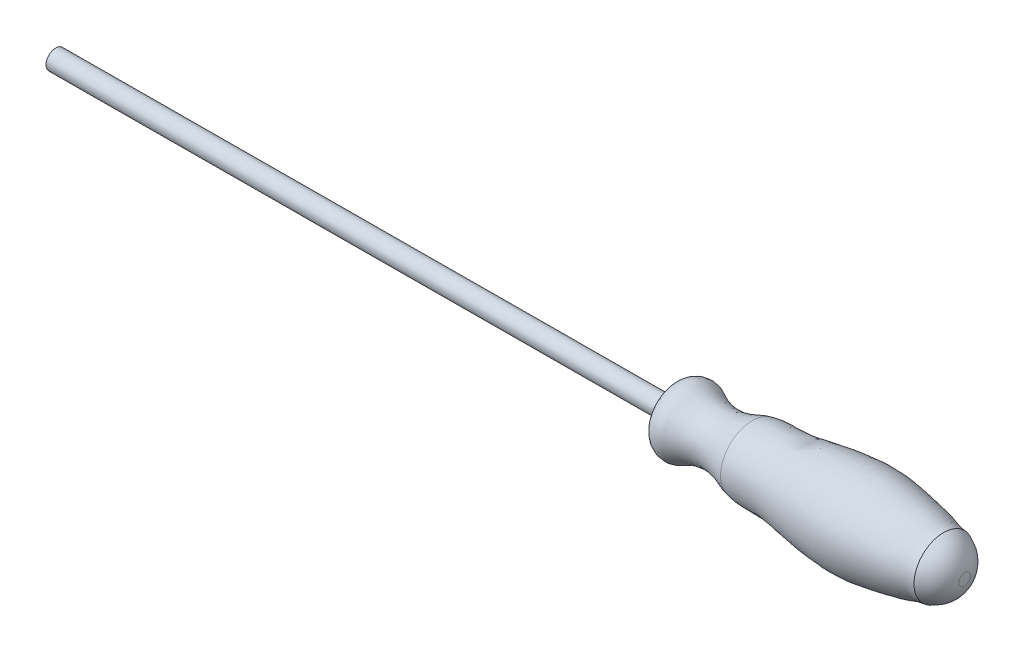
ISO-10303-21;
HEADER;
FILE_DESCRIPTION(('STEP AP214'),'2;1');
FILE_NAME('part.step','',(''),(''),'','','');
FILE_SCHEMA(('AUTOMOTIVE_DESIGN { 1 0 10303 214 1 1 1 1 }'));
ENDSEC;
DATA;
#1=APPLICATION_CONTEXT('core data for automotive mechanical design processes');
#2=APPLICATION_PROTOCOL_DEFINITION('international standard','automotive_design',2000,#1);
#3=PRODUCT_CONTEXT('',#1,'mechanical');
#4=PRODUCT('Part','Part','',(#3));
#5=PRODUCT_RELATED_PRODUCT_CATEGORY('part','',(#4));
#6=PRODUCT_DEFINITION_FORMATION('','',#4);
#7=PRODUCT_DEFINITION_CONTEXT('part definition',#1,'design');
#8=PRODUCT_DEFINITION('design','',#6,#7);
#9=PRODUCT_DEFINITION_SHAPE('','',#8);
#10=(LENGTH_UNIT() NAMED_UNIT(*) SI_UNIT(.MILLI.,.METRE.));
#11=(NAMED_UNIT(*) PLANE_ANGLE_UNIT() SI_UNIT($,.RADIAN.));
#12=(NAMED_UNIT(*) SI_UNIT($,.STERADIAN.) SOLID_ANGLE_UNIT());
#13=UNCERTAINTY_MEASURE_WITH_UNIT(LENGTH_MEASURE(1.E-05),#10,'distance_accuracy_value','');
#14=(GEOMETRIC_REPRESENTATION_CONTEXT(3) GLOBAL_UNCERTAINTY_ASSIGNED_CONTEXT((#13)) GLOBAL_UNIT_ASSIGNED_CONTEXT((#10,
#11,#12)) REPRESENTATION_CONTEXT('',''));
#15=CARTESIAN_POINT('',(0.,0.,0.));
#16=DIRECTION('',(0.,0.,1.));
#17=DIRECTION('',(1.,0.,0.));
#18=AXIS2_PLACEMENT_3D('',#15,#16,#17);
#19=CARTESIAN_POINT('',(0.,-3.40142625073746,0.));
#20=CARTESIAN_POINT('',(-0.15562647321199,-7.16439135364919,0.));
#21=CARTESIAN_POINT('',(0.545364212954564,-10.8774958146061,0.));
#22=B_SPLINE_CURVE_WITH_KNOTS('',2,(#19,#20,#21),.UNSPECIFIED.,.F.,.F.,(3,3),(0.,1.),.UNSPECIFIED.);
#23=CARTESIAN_POINT('',(0.,0.,0.));
#24=DIRECTION('',(-0.999988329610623,-0.00483121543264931,0.));
#25=AXIS1_PLACEMENT('',#23,#24);
#26=SURFACE_OF_REVOLUTION('',#22,#25);
#27=CARTESIAN_POINT('',(-0.0307020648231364,-0.000148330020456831,0.));
#28=DIRECTION('',(-0.999988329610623,-0.00483121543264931,0.));
#29=DIRECTION('',(0.00483121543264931,-0.999988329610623,0.));
#30=AXIS2_PLACEMENT_3D('',#27,#28,#29);
#31=CIRCLE('',#30,3.75);
#32=CARTESIAN_POINT('',(-0.0125850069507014,-3.75010456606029,0.));
#33=VERTEX_POINT('',#32);
#34=EDGE_CURVE('E11',#33,#33,#31,.T.);
#35=ORIENTED_EDGE('',*,*,#34,.F.);
#36=EDGE_LOOP('',(#35));
#37=FACE_BOUND('',#36,.T.);
#38=CARTESIAN_POINT('',(0.49280057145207,0.00238085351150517,0.));
#39=DIRECTION('',(-0.999988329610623,-0.00483121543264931,0.));
#40=DIRECTION('',(0.00483121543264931,-0.999988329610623,0.));
#41=AXIS2_PLACEMENT_3D('',#38,#39,#40);
#42=CIRCLE('',#41,10.8800036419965);
#43=CARTESIAN_POINT('',(0.545364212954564,-10.8774958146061,0.));
#44=VERTEX_POINT('',#43);
#45=EDGE_CURVE('E50',#44,#44,#42,.T.);
#46=ORIENTED_EDGE('',*,*,#45,.T.);
#47=EDGE_LOOP('',(#46));
#48=FACE_BOUND('',#47,.T.);
#49=ADVANCED_FACE('F40',(#37,#48),#26,.F.);
#50=CARTESIAN_POINT('',(0.545364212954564,-10.8774958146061,0.));
#51=CARTESIAN_POINT('',(1.37034871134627,-11.9743869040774,0.));
#52=CARTESIAN_POINT('',(3.32259956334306,-12.8302408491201,0.));
#53=CARTESIAN_POINT('',(6.19462989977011,-12.9244191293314,0.));
#54=CARTESIAN_POINT('',(8.21729207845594,-11.8858709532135,0.));
#55=CARTESIAN_POINT('',(10.5136735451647,-10.6744661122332,0.));
#56=CARTESIAN_POINT('',(13.281514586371,-9.80869703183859,0.));
#57=CARTESIAN_POINT('',(16.6319516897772,-9.22347666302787,0.));
#58=CARTESIAN_POINT('',(20.2629187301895,-9.32596056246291,0.));
#59=CARTESIAN_POINT('',(24.1568373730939,-10.1633752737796,0.));
#60=CARTESIAN_POINT('',(27.1905964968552,-11.558728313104,0.));
#61=CARTESIAN_POINT('',(29.1632772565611,-12.0599366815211,0.));
#62=CARTESIAN_POINT('',(29.7779090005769,-12.2061348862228,0.));
#63=B_SPLINE_CURVE_WITH_KNOTS('',3,(#50,#51,#52,#53,#54,#55,#56,#57,#58,#59,#60,#61,#62),
.UNSPECIFIED.,.F.,.F.,(4,1,1,1,1,1,1,1,1,1,4),(0.,0.120356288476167,0.182103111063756,
0.252493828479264,0.320379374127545,0.416926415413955,0.511670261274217,0.625759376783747,
0.741661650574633,0.867963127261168,0.924773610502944),.UNSPECIFIED.);
#64=CARTESIAN_POINT('',(0.,0.,0.));
#65=DIRECTION('',(-0.999988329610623,-0.00483121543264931,0.));
#66=AXIS1_PLACEMENT('',#64,#65);
#67=SURFACE_OF_REVOLUTION('',#63,#66);
#68=CARTESIAN_POINT('',(29.7182441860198,0.143576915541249,0.));
#69=DIRECTION('',(-0.999988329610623,-0.00483121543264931,0.));
#70=DIRECTION('',(0.00483121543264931,-0.999988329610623,0.));
#71=AXIS2_PLACEMENT_3D('',#68,#69,#70);
#72=CIRCLE('',#71,12.3498559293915);
#73=CARTESIAN_POINT('',(29.7779090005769,-12.2061348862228,0.));
#74=VERTEX_POINT('',#73);
#75=EDGE_CURVE('E196',#74,#74,#72,.T.);
#76=ORIENTED_EDGE('',*,*,#75,.T.);
#77=EDGE_LOOP('',(#76));
#78=FACE_BOUND('',#77,.T.);
#79=ORIENTED_EDGE('',*,*,#45,.F.);
#80=EDGE_LOOP('',(#79));
#81=FACE_BOUND('',#80,.T.);
#82=ADVANCED_FACE('F94',(#78,#81),#67,.F.);
#83=CARTESIAN_POINT('',(29.7779090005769,-12.2061348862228,0.));
#84=CARTESIAN_POINT('',(31.1346179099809,-12.4503532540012,0.));
#85=CARTESIAN_POINT('',(33.1675652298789,-12.8911490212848,0.));
#86=CARTESIAN_POINT('',(36.3876480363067,-12.9050924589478,0.));
#87=CARTESIAN_POINT('',(39.1715363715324,-12.8798778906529,0.));
#88=CARTESIAN_POINT('',(42.6259033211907,-12.9791040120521,0.));
#89=CARTESIAN_POINT('',(46.2180468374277,-13.3469629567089,0.));
#90=CARTESIAN_POINT('',(49.9167304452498,-14.0067787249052,0.));
#91=CARTESIAN_POINT('',(53.6218083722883,-14.6404916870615,0.));
#92=CARTESIAN_POINT('',(57.2661896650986,-15.1744291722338,0.));
#93=CARTESIAN_POINT('',(61.1201600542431,-15.6812353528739,0.));
#94=CARTESIAN_POINT('',(65.1405088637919,-15.9976015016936,0.));
#95=CARTESIAN_POINT('',(69.2720383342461,-16.4213874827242,0.));
#96=CARTESIAN_POINT('',(73.6065603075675,-16.3521229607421,0.));
#97=CARTESIAN_POINT('',(77.7838995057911,-16.2161925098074,0.));
#98=CARTESIAN_POINT('',(81.9902090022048,-15.5315842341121,0.));
#99=CARTESIAN_POINT('',(86.3140591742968,-14.8039570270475,0.));
#100=CARTESIAN_POINT('',(91.8474270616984,-13.8515046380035,0.));
#101=CARTESIAN_POINT('',(97.7508899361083,-12.5390196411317,0.));
#102=CARTESIAN_POINT('',(101.929439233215,-10.9603572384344,0.));
#103=CARTESIAN_POINT('',(103.818425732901,-10.9881922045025,0.));
#104=B_SPLINE_CURVE_WITH_KNOTS('',3,(#83,#84,#85,#86,#87,#88,#89,#90,#91,#92,#93,#94,#95,#96,
#97,#98,#99,#100,#101,#102,#103),.UNSPECIFIED.,.F.,.F.,(4,1,1,1,1,1,1,1,1,1,1,1,1,1,1,1,1,1,4),
(0.,0.0553981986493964,0.0826774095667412,0.128818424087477,0.167035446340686,0.221096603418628,
0.273333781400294,0.317568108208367,0.371733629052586,0.420941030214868,0.473294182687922,
0.533363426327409,0.587167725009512,0.646878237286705,0.700631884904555,0.757710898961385,
0.822668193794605,0.92558882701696,1.),.UNSPECIFIED.);
#105=CARTESIAN_POINT('',(0.,0.,0.));
#106=DIRECTION('',(-0.999988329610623,-0.00483121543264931,0.));
#107=AXIS1_PLACEMENT('',#105,#106);
#108=SURFACE_OF_REVOLUTION('',#104,#107);
#109=CARTESIAN_POINT('',(103.762916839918,0.501306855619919,0.));
#110=DIRECTION('',(-0.999988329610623,-0.00483121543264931,0.));
#111=DIRECTION('',(0.00483121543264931,-0.999988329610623,0.));
#112=AXIS2_PLACEMENT_3D('',#109,#110,#111);
#113=CIRCLE('',#112,11.489633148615);
#114=CARTESIAN_POINT('',(103.818425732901,-10.9881922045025,0.));
#115=VERTEX_POINT('',#114);
#116=EDGE_CURVE('E76',#115,#115,#113,.T.);
#117=ORIENTED_EDGE('',*,*,#116,.T.);
#118=EDGE_LOOP('',(#117));
#119=FACE_BOUND('',#118,.T.);
#120=ORIENTED_EDGE('',*,*,#75,.F.);
#121=EDGE_LOOP('',(#120));
#122=FACE_BOUND('',#121,.T.);
#123=ADVANCED_FACE('F98',(#119,#122),#108,.F.);
#124=CARTESIAN_POINT('',(103.818425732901,-10.9881922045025,0.));
#125=CARTESIAN_POINT('',(105.386632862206,-10.3955734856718,0.));
#126=CARTESIAN_POINT('',(109.210159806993,-8.22697266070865,0.));
#127=CARTESIAN_POINT('',(111.462986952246,-4.23080075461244,0.));
#128=CARTESIAN_POINT('',(111.922279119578,-1.65220556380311,0.));
#129=B_SPLINE_CURVE_WITH_KNOTS('',3,(#124,#125,#126,#127,#128),.UNSPECIFIED.,.F.,.F.,(4,1,4),
(0.,0.39082533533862,1.),.UNSPECIFIED.);
#130=CARTESIAN_POINT('',(0.,0.,0.));
#131=DIRECTION('',(-0.999988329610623,-0.00483121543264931,0.));
#132=AXIS1_PLACEMENT('',#130,#131);
#133=SURFACE_OF_REVOLUTION('',#129,#132);
#134=CARTESIAN_POINT('',(111.911684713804,0.540675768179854,0.));
#135=DIRECTION('',(-0.999988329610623,-0.00483121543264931,0.));
#136=DIRECTION('',(0.00483121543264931,-0.999988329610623,0.));
#137=AXIS2_PLACEMENT_3D('',#134,#135,#136);
#138=CIRCLE('',#137,2.19290692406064);
#139=CARTESIAN_POINT('',(111.922279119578,-1.65220556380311,0.));
#140=VERTEX_POINT('',#139);
#141=EDGE_CURVE('E70',#140,#140,#138,.T.);
#142=ORIENTED_EDGE('',*,*,#141,.T.);
#143=EDGE_LOOP('',(#142));
#144=FACE_BOUND('',#143,.T.);
#145=ORIENTED_EDGE('',*,*,#116,.F.);
#146=EDGE_LOOP('',(#145));
#147=FACE_BOUND('',#146,.T.);
#148=ADVANCED_FACE('F102',(#144,#147),#133,.F.);
#149=CARTESIAN_POINT('',(111.922279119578,-1.65220556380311,0.));
#150=CARTESIAN_POINT('',(112.005297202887,-0.555338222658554,0.));
#151=CARTESIAN_POINT('',(112.,0.541102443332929,0.));
#152=B_SPLINE_CURVE_WITH_KNOTS('',2,(#149,#150,#151),.UNSPECIFIED.,.F.,.F.,(3,3),(0.5,1.),.UNSPECIFIED.);
#153=CARTESIAN_POINT('',(0.,0.,0.));
#154=DIRECTION('',(-0.999988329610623,-0.00483121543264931,0.));
#155=AXIS1_PLACEMENT('',#153,#154);
#156=SURFACE_OF_REVOLUTION('',#152,#155);
#157=CARTESIAN_POINT('',(112.,0.541102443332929,0.));
#158=VERTEX_POINT('',#157);
#159=VERTEX_LOOP('',#158);
#160=FACE_BOUND('',#159,.T.);
#161=ORIENTED_EDGE('',*,*,#141,.F.);
#162=EDGE_LOOP('',(#161));
#163=FACE_BOUND('',#162,.T.);
#164=ADVANCED_FACE('F126',(#160,#163),#156,.F.);
#165=CARTESIAN_POINT('',(-240.013631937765,-1.15957109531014,0.));
#166=DIRECTION('',(0.999988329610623,0.00483121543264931,0.));
#167=DIRECTION('',(-0.00483121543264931,0.999988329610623,0.));
#168=AXIS2_PLACEMENT_3D('',#165,#166,#167);
#169=CYLINDRICAL_SURFACE('',#168,3.75);
#170=ORIENTED_EDGE('',*,*,#34,.T.);
#171=EDGE_LOOP('',(#170));
#172=FACE_BOUND('',#171,.T.);
#173=CARTESIAN_POINT('',(-240.013631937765,-1.15957109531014,0.));
#174=DIRECTION('',(0.999988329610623,0.00483121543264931,0.));
#175=DIRECTION('',(-0.00483121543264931,0.999988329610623,0.));
#176=AXIS2_PLACEMENT_3D('',#173,#174,#175);
#177=CIRCLE('',#176,3.75);
#178=CARTESIAN_POINT('',(-240.031748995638,2.5903851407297,0.));
#179=VERTEX_POINT('',#178);
#180=EDGE_CURVE('E71',#179,#179,#177,.T.);
#181=ORIENTED_EDGE('',*,*,#180,.T.);
#182=EDGE_LOOP('',(#181));
#183=FACE_BOUND('',#182,.T.);
#184=ADVANCED_FACE('F129',(#172,#183),#169,.T.);
#185=CARTESIAN_POINT('',(-240.013631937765,-1.15957109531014,0.));
#186=DIRECTION('',(0.999988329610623,0.00483121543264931,0.));
#187=DIRECTION('',(-0.00483121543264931,0.999988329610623,0.));
#188=AXIS2_PLACEMENT_3D('',#185,#186,#187);
#189=PLANE('',#188);
#190=ORIENTED_EDGE('',*,*,#180,.F.);
#191=EDGE_LOOP('',(#190));
#192=FACE_BOUND('',#191,.T.);
#193=ADVANCED_FACE('F131',(#192),#189,.F.);
#194=CLOSED_SHELL('',(#49,#82,#123,#148,#164,#184,#193));
#195=CARTESIAN_POINT('',(0.,0.,0.));
#196=DIRECTION('',(-0.999988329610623,-0.00483121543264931,0.));
#197=DIRECTION('',(0.00483121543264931,-0.999988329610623,0.));
#198=AXIS2_PLACEMENT_3D('',#195,#196,#197);
#199=CONICAL_SURFACE('',#198,0.,1.5659650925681);
#200=CARTESIAN_POINT('',(-0.0164328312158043,-7.93914743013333E-05,0.));
#201=DIRECTION('',(-0.999988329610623,-0.00483121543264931,0.));
#202=DIRECTION('',(0.00483121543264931,-0.999988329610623,0.));
#203=AXIS2_PLACEMENT_3D('',#200,#201,#202);
#204=CIRCLE('',#203,3.40138655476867);
#205=CARTESIAN_POINT('',(0.,-3.40142625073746,0.));
#206=VERTEX_POINT('',#205);
#207=EDGE_CURVE('E68',#206,#206,#204,.F.);
#208=ORIENTED_EDGE('',*,*,#207,.F.);
#209=EDGE_LOOP('',(#208));
#210=FACE_BOUND('',#209,.T.);
#211=CARTESIAN_POINT('',(0.,0.,0.));
#212=VERTEX_POINT('',#211);
#213=VERTEX_LOOP('',#212);
#214=FACE_BOUND('',#213,.T.);
#215=ADVANCED_FACE('F42',(#210,#214),#199,.F.);
#216=CARTESIAN_POINT('',(-0.0164328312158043,-7.93914743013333E-05,0.));
#217=DIRECTION('',(0.999988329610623,0.00483121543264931,0.));
#218=DIRECTION('',(-0.00483121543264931,0.999988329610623,0.));
#219=AXIS2_PLACEMENT_3D('',#216,#217,#218);
#220=PLANE('',#219);
#221=ORIENTED_EDGE('',*,*,#207,.T.);
#222=EDGE_LOOP('',(#221));
#223=FACE_BOUND('',#222,.T.);
#224=ADVANCED_FACE('F57',(#223),#220,.T.);
#225=CLOSED_SHELL('',(#215,#224));
#226=ORIENTED_CLOSED_SHELL('',*,#225,.T.);
#227=BREP_WITH_VOIDS('B2',#194,(#226));
#228=ADVANCED_BREP_SHAPE_REPRESENTATION('',(#18,#227),#14);
#229=SHAPE_DEFINITION_REPRESENTATION(#9,#228);
ENDSEC;
END-ISO-10303-21;
